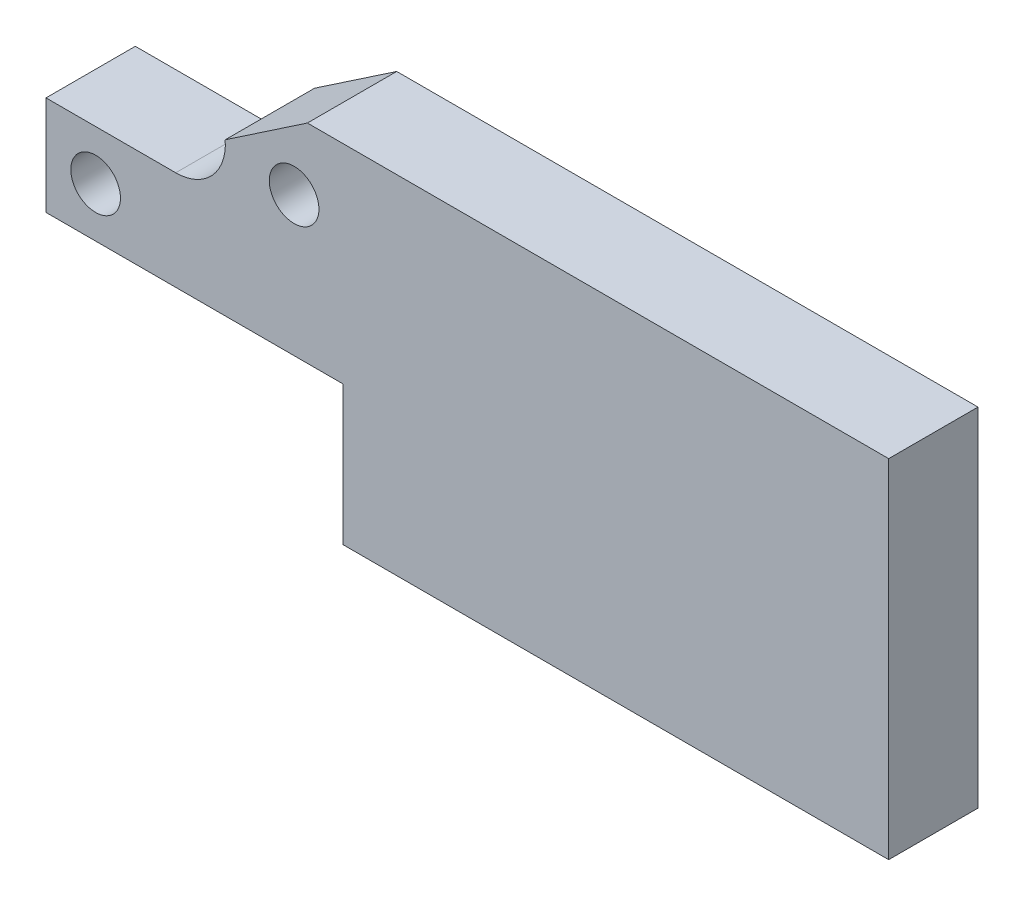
ISO-10303-21;
HEADER;
FILE_DESCRIPTION(('STEP AP214'),'2;1');
FILE_NAME('part.step','',(''),(''),'','','');
FILE_SCHEMA(('AUTOMOTIVE_DESIGN { 1 0 10303 214 1 1 1 1 }'));
ENDSEC;
DATA;
#1=APPLICATION_CONTEXT('core data for automotive mechanical design processes');
#2=APPLICATION_PROTOCOL_DEFINITION('international standard','automotive_design',2000,#1);
#3=PRODUCT_CONTEXT('',#1,'mechanical');
#4=PRODUCT('Part','Part','',(#3));
#5=PRODUCT_RELATED_PRODUCT_CATEGORY('part','',(#4));
#6=PRODUCT_DEFINITION_FORMATION('','',#4);
#7=PRODUCT_DEFINITION_CONTEXT('part definition',#1,'design');
#8=PRODUCT_DEFINITION('design','',#6,#7);
#9=PRODUCT_DEFINITION_SHAPE('','',#8);
#10=(LENGTH_UNIT() NAMED_UNIT(*) SI_UNIT(.MILLI.,.METRE.));
#11=(NAMED_UNIT(*) PLANE_ANGLE_UNIT() SI_UNIT($,.RADIAN.));
#12=(NAMED_UNIT(*) SI_UNIT($,.STERADIAN.) SOLID_ANGLE_UNIT());
#13=UNCERTAINTY_MEASURE_WITH_UNIT(LENGTH_MEASURE(1.E-05),#10,'distance_accuracy_value','');
#14=(GEOMETRIC_REPRESENTATION_CONTEXT(3) GLOBAL_UNCERTAINTY_ASSIGNED_CONTEXT((#13)) GLOBAL_UNIT_ASSIGNED_CONTEXT((#10,
#11,#12)) REPRESENTATION_CONTEXT('',''));
#15=CARTESIAN_POINT('',(0.,0.,0.));
#16=DIRECTION('',(0.,0.,1.));
#17=DIRECTION('',(1.,0.,0.));
#18=AXIS2_PLACEMENT_3D('',#15,#16,#17);
#19=CARTESIAN_POINT('',(0.,2.80503622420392,1.8));
#20=DIRECTION('',(0.,0.,1.));
#21=DIRECTION('',(1.,0.,0.));
#22=AXIS2_PLACEMENT_3D('',#19,#20,#21);
#23=PLANE('',#22);
#24=CARTESIAN_POINT('',(-0.98229205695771,5.61137517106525,1.8));
#25=DIRECTION('',(0.,0.,1.));
#26=DIRECTION('',(1.,0.,0.));
#27=AXIS2_PLACEMENT_3D('',#24,#25,#26);
#28=CIRCLE('',#27,0.500000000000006);
#29=CARTESIAN_POINT('',(-0.482292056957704,5.61137517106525,1.8));
#30=VERTEX_POINT('',#29);
#31=EDGE_CURVE('E188',#30,#30,#28,.T.);
#32=ORIENTED_EDGE('',*,*,#31,.F.);
#33=EDGE_LOOP('',(#32));
#34=FACE_BOUND('',#33,.T.);
#35=DIRECTION('',(0.,-1.,0.));
#36=VECTOR('',#35,1.);
#37=CARTESIAN_POINT('',(0.,0.,1.8));
#38=LINE('',#37,#36);
#39=CARTESIAN_POINT('',(0.,2.80503622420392,1.8));
#40=VERTEX_POINT('',#39);
#41=CARTESIAN_POINT('',(0.,0.,1.8));
#42=VERTEX_POINT('',#41);
#43=EDGE_CURVE('E113',#40,#42,#38,.T.);
#44=ORIENTED_EDGE('',*,*,#43,.T.);
#45=DIRECTION('',(1.,0.,0.));
#46=VECTOR('',#45,1.);
#47=CARTESIAN_POINT('',(0.,0.,1.8));
#48=LINE('',#47,#46);
#49=CARTESIAN_POINT('',(11.,0.,1.8));
#50=VERTEX_POINT('',#49);
#51=EDGE_CURVE('E103',#42,#50,#48,.T.);
#52=ORIENTED_EDGE('',*,*,#51,.T.);
#53=DIRECTION('',(0.,1.,0.));
#54=VECTOR('',#53,1.);
#55=CARTESIAN_POINT('',(11.,0.,1.8));
#56=LINE('',#55,#54);
#57=CARTESIAN_POINT('',(11.,7.,1.8));
#58=VERTEX_POINT('',#57);
#59=EDGE_CURVE('E112',#50,#58,#56,.T.);
#60=ORIENTED_EDGE('',*,*,#59,.T.);
#61=DIRECTION('',(-1.,0.,0.));
#62=VECTOR('',#61,1.);
#63=CARTESIAN_POINT('',(0.,7.,1.8));
#64=LINE('',#63,#62);
#65=CARTESIAN_POINT('',(-0.714484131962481,6.99999999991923,1.8));
#66=VERTEX_POINT('',#65);
#67=EDGE_CURVE('E164',#58,#66,#64,.T.);
#68=ORIENTED_EDGE('',*,*,#67,.T.);
#69=DIRECTION('',(-0.828216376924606,-0.560408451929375,0.));
#70=VECTOR('',#69,1.);
#71=CARTESIAN_POINT('',(-0.714484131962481,6.99999999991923,1.8));
#72=LINE('',#71,#70);
#73=CARTESIAN_POINT('',(-2.37091688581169,5.87918309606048,1.8));
#74=VERTEX_POINT('',#73);
#75=EDGE_CURVE('E198',#66,#74,#72,.T.);
#76=ORIENTED_EDGE('',*,*,#75,.T.);
#77=CARTESIAN_POINT('',(-3.36816421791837,5.80503622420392,1.8));
#78=DIRECTION('',(0.,0.,1.));
#79=DIRECTION('',(1.,0.,0.));
#80=AXIS2_PLACEMENT_3D('',#77,#78,#79);
#81=CIRCLE('',#80,1.);
#82=CARTESIAN_POINT('',(-3.36816421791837,4.80503622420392,1.8));
#83=VERTEX_POINT('',#82);
#84=EDGE_CURVE('E11',#74,#83,#81,.F.);
#85=ORIENTED_EDGE('',*,*,#84,.T.);
#86=DIRECTION('',(-1.,0.,0.));
#87=VECTOR('',#86,1.);
#88=CARTESIAN_POINT('',(-1.64410079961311,4.80503622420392,1.8));
#89=LINE('',#88,#87);
#90=CARTESIAN_POINT('',(-5.98229205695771,4.80503622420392,1.8));
#91=VERTEX_POINT('',#90);
#92=EDGE_CURVE('E196',#83,#91,#89,.T.);
#93=ORIENTED_EDGE('',*,*,#92,.T.);
#94=DIRECTION('',(0.,-1.,0.));
#95=VECTOR('',#94,1.);
#96=CARTESIAN_POINT('',(-5.98229205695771,4.80503622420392,1.8));
#97=LINE('',#96,#95);
#98=CARTESIAN_POINT('',(-5.98229205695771,2.80503622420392,1.8));
#99=VERTEX_POINT('',#98);
#100=EDGE_CURVE('E194',#91,#99,#97,.T.);
#101=ORIENTED_EDGE('',*,*,#100,.T.);
#102=DIRECTION('',(1.,0.,0.));
#103=VECTOR('',#102,1.);
#104=CARTESIAN_POINT('',(0.,2.80503622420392,1.8));
#105=LINE('',#104,#103);
#106=EDGE_CURVE('E118',#99,#40,#105,.T.);
#107=ORIENTED_EDGE('',*,*,#106,.T.);
#108=EDGE_LOOP('',(#44,#52,#60,#68,#76,#85,#93,#101,#107));
#109=FACE_BOUND('',#108,.T.);
#110=CARTESIAN_POINT('',(-4.98229205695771,3.80503622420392,1.8));
#111=DIRECTION('',(0.,0.,1.));
#112=DIRECTION('',(1.,0.,0.));
#113=AXIS2_PLACEMENT_3D('',#110,#111,#112);
#114=CIRCLE('',#113,0.500000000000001);
#115=CARTESIAN_POINT('',(-4.48229205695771,3.80503622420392,1.8));
#116=VERTEX_POINT('',#115);
#117=EDGE_CURVE('E203',#116,#116,#114,.T.);
#118=ORIENTED_EDGE('',*,*,#117,.F.);
#119=EDGE_LOOP('',(#118));
#120=FACE_BOUND('',#119,.T.);
#121=ADVANCED_FACE('F34',(#34,#109,#120),#23,.T.);
#122=CARTESIAN_POINT('',(0.,2.80503622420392,0.));
#123=DIRECTION('',(0.,0.,1.));
#124=DIRECTION('',(1.,0.,0.));
#125=AXIS2_PLACEMENT_3D('',#122,#123,#124);
#126=PLANE('',#125);
#127=CARTESIAN_POINT('',(-0.98229205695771,5.61137517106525,0.));
#128=DIRECTION('',(0.,0.,1.));
#129=DIRECTION('',(1.,0.,0.));
#130=AXIS2_PLACEMENT_3D('',#127,#128,#129);
#131=CIRCLE('',#130,0.500000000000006);
#132=CARTESIAN_POINT('',(-0.482292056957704,5.61137517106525,0.));
#133=VERTEX_POINT('',#132);
#134=EDGE_CURVE('E190',#133,#133,#131,.T.);
#135=ORIENTED_EDGE('',*,*,#134,.T.);
#136=EDGE_LOOP('',(#135));
#137=FACE_BOUND('',#136,.T.);
#138=DIRECTION('',(0.,-1.,0.));
#139=VECTOR('',#138,1.);
#140=CARTESIAN_POINT('',(0.,0.,0.));
#141=LINE('',#140,#139);
#142=CARTESIAN_POINT('',(0.,2.80503622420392,0.));
#143=VERTEX_POINT('',#142);
#144=CARTESIAN_POINT('',(0.,0.,0.));
#145=VERTEX_POINT('',#144);
#146=EDGE_CURVE('E126',#143,#145,#141,.T.);
#147=ORIENTED_EDGE('',*,*,#146,.F.);
#148=DIRECTION('',(1.,0.,0.));
#149=VECTOR('',#148,1.);
#150=CARTESIAN_POINT('',(0.,2.80503622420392,0.));
#151=LINE('',#150,#149);
#152=CARTESIAN_POINT('',(-5.98229205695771,2.80503622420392,0.));
#153=VERTEX_POINT('',#152);
#154=EDGE_CURVE('E122',#153,#143,#151,.T.);
#155=ORIENTED_EDGE('',*,*,#154,.F.);
#156=DIRECTION('',(0.,-1.,0.));
#157=VECTOR('',#156,1.);
#158=CARTESIAN_POINT('',(-5.98229205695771,4.80503622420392,0.));
#159=LINE('',#158,#157);
#160=CARTESIAN_POINT('',(-5.98229205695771,4.80503622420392,0.));
#161=VERTEX_POINT('',#160);
#162=EDGE_CURVE('E177',#161,#153,#159,.T.);
#163=ORIENTED_EDGE('',*,*,#162,.F.);
#164=DIRECTION('',(-1.,0.,0.));
#165=VECTOR('',#164,1.);
#166=CARTESIAN_POINT('',(-1.64410079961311,4.80503622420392,0.));
#167=LINE('',#166,#165);
#168=CARTESIAN_POINT('',(-3.36816421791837,4.80503622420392,0.));
#169=VERTEX_POINT('',#168);
#170=EDGE_CURVE('E141',#169,#161,#167,.T.);
#171=ORIENTED_EDGE('',*,*,#170,.F.);
#172=CARTESIAN_POINT('',(-3.36816421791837,5.80503622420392,0.));
#173=DIRECTION('',(0.,0.,1.));
#174=DIRECTION('',(1.,0.,0.));
#175=AXIS2_PLACEMENT_3D('',#172,#173,#174);
#176=CIRCLE('',#175,1.);
#177=CARTESIAN_POINT('',(-2.37091688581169,5.87918309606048,0.));
#178=VERTEX_POINT('',#177);
#179=EDGE_CURVE('E42',#169,#178,#176,.T.);
#180=ORIENTED_EDGE('',*,*,#179,.T.);
#181=DIRECTION('',(-0.828216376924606,-0.560408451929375,0.));
#182=VECTOR('',#181,1.);
#183=CARTESIAN_POINT('',(-0.714484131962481,6.99999999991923,0.));
#184=LINE('',#183,#182);
#185=CARTESIAN_POINT('',(-0.714484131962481,6.99999999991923,0.));
#186=VERTEX_POINT('',#185);
#187=EDGE_CURVE('E139',#186,#178,#184,.T.);
#188=ORIENTED_EDGE('',*,*,#187,.F.);
#189=DIRECTION('',(-1.,-1.13052096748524E-10,0.));
#190=VECTOR('',#189,1.);
#191=CARTESIAN_POINT('',(-0.714484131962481,6.99999999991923,0.));
#192=LINE('',#191,#190);
#193=CARTESIAN_POINT('',(11.,7.,0.));
#194=VERTEX_POINT('',#193);
#195=EDGE_CURVE('E150',#194,#186,#192,.T.);
#196=ORIENTED_EDGE('',*,*,#195,.F.);
#197=DIRECTION('',(0.,1.,0.));
#198=VECTOR('',#197,1.);
#199=CARTESIAN_POINT('',(11.,0.,0.));
#200=LINE('',#199,#198);
#201=CARTESIAN_POINT('',(11.,0.,0.));
#202=VERTEX_POINT('',#201);
#203=EDGE_CURVE('E169',#202,#194,#200,.T.);
#204=ORIENTED_EDGE('',*,*,#203,.F.);
#205=DIRECTION('',(1.,0.,0.));
#206=VECTOR('',#205,1.);
#207=CARTESIAN_POINT('',(0.,0.,0.));
#208=LINE('',#207,#206);
#209=EDGE_CURVE('E170',#145,#202,#208,.T.);
#210=ORIENTED_EDGE('',*,*,#209,.F.);
#211=EDGE_LOOP('',(#147,#155,#163,#171,#180,#188,#196,#204,#210));
#212=FACE_BOUND('',#211,.T.);
#213=CARTESIAN_POINT('',(-4.98229205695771,3.80503622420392,0.));
#214=DIRECTION('',(0.,0.,1.));
#215=DIRECTION('',(1.,0.,0.));
#216=AXIS2_PLACEMENT_3D('',#213,#214,#215);
#217=CIRCLE('',#216,0.500000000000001);
#218=CARTESIAN_POINT('',(-4.48229205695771,3.80503622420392,0.));
#219=VERTEX_POINT('',#218);
#220=EDGE_CURVE('E205',#219,#219,#217,.T.);
#221=ORIENTED_EDGE('',*,*,#220,.T.);
#222=EDGE_LOOP('',(#221));
#223=FACE_BOUND('',#222,.T.);
#224=ADVANCED_FACE('F137',(#137,#212,#223),#126,.F.);
#225=CARTESIAN_POINT('',(0.,0.,1.8));
#226=DIRECTION('',(1.,0.,0.));
#227=DIRECTION('',(0.,0.,-1.));
#228=AXIS2_PLACEMENT_3D('',#225,#226,#227);
#229=PLANE('',#228);
#230=ORIENTED_EDGE('',*,*,#146,.T.);
#231=DIRECTION('',(0.,0.,-1.));
#232=VECTOR('',#231,1.);
#233=CARTESIAN_POINT('',(0.,0.,1.8));
#234=LINE('',#233,#232);
#235=EDGE_CURVE('E107',#42,#145,#234,.T.);
#236=ORIENTED_EDGE('',*,*,#235,.F.);
#237=ORIENTED_EDGE('',*,*,#43,.F.);
#238=DIRECTION('',(0.,0.,-1.));
#239=VECTOR('',#238,1.);
#240=CARTESIAN_POINT('',(0.,2.80503622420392,1.8));
#241=LINE('',#240,#239);
#242=EDGE_CURVE('E180',#40,#143,#241,.T.);
#243=ORIENTED_EDGE('',*,*,#242,.T.);
#244=EDGE_LOOP('',(#230,#236,#237,#243));
#245=FACE_BOUND('',#244,.T.);
#246=ADVANCED_FACE('F124',(#245),#229,.F.);
#247=CARTESIAN_POINT('',(0.,0.,1.8));
#248=DIRECTION('',(0.,1.,0.));
#249=DIRECTION('',(0.,0.,1.));
#250=AXIS2_PLACEMENT_3D('',#247,#248,#249);
#251=PLANE('',#250);
#252=ORIENTED_EDGE('',*,*,#209,.T.);
#253=DIRECTION('',(0.,0.,-1.));
#254=VECTOR('',#253,1.);
#255=CARTESIAN_POINT('',(11.,0.,1.8));
#256=LINE('',#255,#254);
#257=EDGE_CURVE('E110',#50,#202,#256,.T.);
#258=ORIENTED_EDGE('',*,*,#257,.F.);
#259=ORIENTED_EDGE('',*,*,#51,.F.);
#260=ORIENTED_EDGE('',*,*,#235,.T.);
#261=EDGE_LOOP('',(#252,#258,#259,#260));
#262=FACE_BOUND('',#261,.T.);
#263=ADVANCED_FACE('F105',(#262),#251,.F.);
#264=CARTESIAN_POINT('',(11.,0.,1.8));
#265=DIRECTION('',(-1.,0.,0.));
#266=DIRECTION('',(0.,0.,1.));
#267=AXIS2_PLACEMENT_3D('',#264,#265,#266);
#268=PLANE('',#267);
#269=ORIENTED_EDGE('',*,*,#203,.T.);
#270=DIRECTION('',(0.,0.,-1.));
#271=VECTOR('',#270,1.);
#272=CARTESIAN_POINT('',(11.,7.,1.8));
#273=LINE('',#272,#271);
#274=EDGE_CURVE('E130',#58,#194,#273,.T.);
#275=ORIENTED_EDGE('',*,*,#274,.F.);
#276=ORIENTED_EDGE('',*,*,#59,.F.);
#277=ORIENTED_EDGE('',*,*,#257,.T.);
#278=EDGE_LOOP('',(#269,#275,#276,#277));
#279=FACE_BOUND('',#278,.T.);
#280=ADVANCED_FACE('F167',(#279),#268,.F.);
#281=CARTESIAN_POINT('',(-0.714484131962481,6.99999999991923,1.8));
#282=DIRECTION('',(1.13052096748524E-10,-1.,0.));
#283=DIRECTION('',(1.,1.13052096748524E-10,0.));
#284=AXIS2_PLACEMENT_3D('',#281,#282,#283);
#285=PLANE('',#284);
#286=ORIENTED_EDGE('',*,*,#195,.T.);
#287=DIRECTION('',(0.,0.,-1.));
#288=VECTOR('',#287,1.);
#289=CARTESIAN_POINT('',(-0.714484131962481,6.99999999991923,1.8));
#290=LINE('',#289,#288);
#291=EDGE_CURVE('E149',#66,#186,#290,.T.);
#292=ORIENTED_EDGE('',*,*,#291,.F.);
#293=ORIENTED_EDGE('',*,*,#67,.F.);
#294=ORIENTED_EDGE('',*,*,#274,.T.);
#295=EDGE_LOOP('',(#286,#292,#293,#294));
#296=FACE_BOUND('',#295,.T.);
#297=ADVANCED_FACE('F163',(#296),#285,.F.);
#298=CARTESIAN_POINT('',(-0.714484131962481,6.99999999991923,1.8));
#299=DIRECTION('',(0.560408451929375,-0.828216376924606,0.));
#300=DIRECTION('',(0.828216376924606,0.560408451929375,0.));
#301=AXIS2_PLACEMENT_3D('',#298,#299,#300);
#302=PLANE('',#301);
#303=ORIENTED_EDGE('',*,*,#187,.T.);
#304=DIRECTION('',(0.,0.,-1.));
#305=VECTOR('',#304,1.);
#306=CARTESIAN_POINT('',(-2.37091688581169,5.87918309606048,1.8));
#307=LINE('',#306,#305);
#308=EDGE_CURVE('E147',#74,#178,#307,.T.);
#309=ORIENTED_EDGE('',*,*,#308,.F.);
#310=ORIENTED_EDGE('',*,*,#75,.F.);
#311=ORIENTED_EDGE('',*,*,#291,.T.);
#312=EDGE_LOOP('',(#303,#309,#310,#311));
#313=FACE_BOUND('',#312,.T.);
#314=ADVANCED_FACE('F145',(#313),#302,.F.);
#315=CARTESIAN_POINT('',(-1.64410079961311,4.80503622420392,1.8));
#316=DIRECTION('',(0.,-1.,0.));
#317=DIRECTION('',(0.,0.,-1.));
#318=AXIS2_PLACEMENT_3D('',#315,#316,#317);
#319=PLANE('',#318);
#320=ORIENTED_EDGE('',*,*,#92,.F.);
#321=DIRECTION('',(0.,0.,-1.));
#322=VECTOR('',#321,1.);
#323=CARTESIAN_POINT('',(-3.36816421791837,4.80503622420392,1.8));
#324=LINE('',#323,#322);
#325=EDGE_CURVE('E127',#83,#169,#324,.T.);
#326=ORIENTED_EDGE('',*,*,#325,.T.);
#327=ORIENTED_EDGE('',*,*,#170,.T.);
#328=DIRECTION('',(0.,0.,-1.));
#329=VECTOR('',#328,1.);
#330=CARTESIAN_POINT('',(-5.98229205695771,4.80503622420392,1.8));
#331=LINE('',#330,#329);
#332=EDGE_CURVE('E152',#91,#161,#331,.T.);
#333=ORIENTED_EDGE('',*,*,#332,.F.);
#334=EDGE_LOOP('',(#320,#326,#327,#333));
#335=FACE_BOUND('',#334,.T.);
#336=ADVANCED_FACE('F231',(#335),#319,.F.);
#337=CARTESIAN_POINT('',(-5.98229205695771,4.80503622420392,1.8));
#338=DIRECTION('',(1.,0.,0.));
#339=DIRECTION('',(0.,0.,-1.));
#340=AXIS2_PLACEMENT_3D('',#337,#338,#339);
#341=PLANE('',#340);
#342=ORIENTED_EDGE('',*,*,#162,.T.);
#343=DIRECTION('',(0.,0.,-1.));
#344=VECTOR('',#343,1.);
#345=CARTESIAN_POINT('',(-5.98229205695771,2.80503622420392,1.8));
#346=LINE('',#345,#344);
#347=EDGE_CURVE('E156',#99,#153,#346,.T.);
#348=ORIENTED_EDGE('',*,*,#347,.F.);
#349=ORIENTED_EDGE('',*,*,#100,.F.);
#350=ORIENTED_EDGE('',*,*,#332,.T.);
#351=EDGE_LOOP('',(#342,#348,#349,#350));
#352=FACE_BOUND('',#351,.T.);
#353=ADVANCED_FACE('F228',(#352),#341,.F.);
#354=CARTESIAN_POINT('',(0.,2.80503622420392,1.8));
#355=DIRECTION('',(0.,1.,0.));
#356=DIRECTION('',(-1.,0.,0.));
#357=AXIS2_PLACEMENT_3D('',#354,#355,#356);
#358=PLANE('',#357);
#359=ORIENTED_EDGE('',*,*,#154,.T.);
#360=ORIENTED_EDGE('',*,*,#242,.F.);
#361=ORIENTED_EDGE('',*,*,#106,.F.);
#362=ORIENTED_EDGE('',*,*,#347,.T.);
#363=EDGE_LOOP('',(#359,#360,#361,#362));
#364=FACE_BOUND('',#363,.T.);
#365=ADVANCED_FACE('F185',(#364),#358,.F.);
#366=CARTESIAN_POINT('',(-0.98229205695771,5.61137517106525,1.8));
#367=DIRECTION('',(0.,0.,-1.));
#368=DIRECTION('',(-1.,0.,0.));
#369=AXIS2_PLACEMENT_3D('',#366,#367,#368);
#370=CYLINDRICAL_SURFACE('',#369,0.500000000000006);
#371=ORIENTED_EDGE('',*,*,#31,.T.);
#372=EDGE_LOOP('',(#371));
#373=FACE_BOUND('',#372,.T.);
#374=ORIENTED_EDGE('',*,*,#134,.F.);
#375=EDGE_LOOP('',(#374));
#376=FACE_BOUND('',#375,.T.);
#377=ADVANCED_FACE('F223',(#373,#376),#370,.F.);
#378=CARTESIAN_POINT('',(-4.98229205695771,3.80503622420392,1.8));
#379=DIRECTION('',(0.,0.,-1.));
#380=DIRECTION('',(-1.,0.,0.));
#381=AXIS2_PLACEMENT_3D('',#378,#379,#380);
#382=CYLINDRICAL_SURFACE('',#381,0.500000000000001);
#383=ORIENTED_EDGE('',*,*,#117,.T.);
#384=EDGE_LOOP('',(#383));
#385=FACE_BOUND('',#384,.T.);
#386=ORIENTED_EDGE('',*,*,#220,.F.);
#387=EDGE_LOOP('',(#386));
#388=FACE_BOUND('',#387,.T.);
#389=ADVANCED_FACE('F211',(#385,#388),#382,.F.);
#390=CARTESIAN_POINT('',(-3.36816421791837,5.80503622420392,1.8));
#391=DIRECTION('',(0.,0.,-1.));
#392=DIRECTION('',(-1.,0.,0.));
#393=AXIS2_PLACEMENT_3D('',#390,#391,#392);
#394=CYLINDRICAL_SURFACE('',#393,1.);
#395=ORIENTED_EDGE('',*,*,#84,.F.);
#396=ORIENTED_EDGE('',*,*,#308,.T.);
#397=ORIENTED_EDGE('',*,*,#179,.F.);
#398=ORIENTED_EDGE('',*,*,#325,.F.);
#399=EDGE_LOOP('',(#395,#396,#397,#398));
#400=FACE_BOUND('',#399,.T.);
#401=ADVANCED_FACE('F36',(#400),#394,.F.);
#402=CLOSED_SHELL('',(#121,#224,#246,#263,#280,#297,#314,#336,#353,#365,#377,#389,#401));
#403=MANIFOLD_SOLID_BREP('B2',#402);
#404=ADVANCED_BREP_SHAPE_REPRESENTATION('',(#18,#403),#14);
#405=SHAPE_DEFINITION_REPRESENTATION(#9,#404);
ENDSEC;
END-ISO-10303-21;
